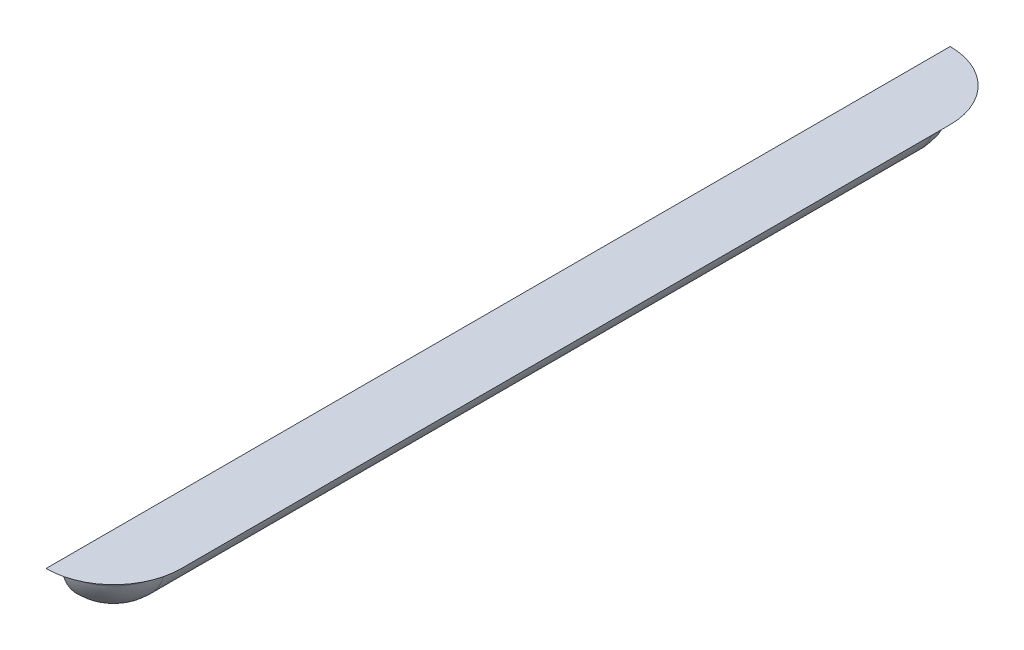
from build123d import *

# Parameters (mm, degrees)
SKETCH1_W           = 30
SKETCH1_H           = 3.464243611
BASE_EXTRUDE_DEPTH  = 60
BOSS_EXTRUDE1_DEPTH = 44
BOSS_REVOLVE2_ANGLE = 90
BOSS_REVOLVE3_ANGLE = 90
FILLET1_R           = 2
SKETCH8_W           = 120
SKETCH8_H           = 3.464243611
CUT_EXTRUDE4_DEPTH  = 68.349833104


with BuildPart() as part:
    # Sketch1 → Base-Extrude (new, symmetric)
    with BuildSketch(Plane.XY):
        with Locations((0, 1.732121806)):
            Rectangle(SKETCH1_W, SKETCH1_H)
    extrude(amount=BASE_EXTRUDE_DEPTH, both=True)

    # Louver Body → Boss-Extrude1 (add, symmetric)
    with BuildSketch(Plane.XY):
        with BuildLine():
            Line((-3, 0), (-3, -6))
            ThreePointArc((-3, -6), (1.242640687, -4.242640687), (3, 0))
            Line((3, 0), (-3, 0))
        make_face()
    extrude(amount=BOSS_EXTRUDE1_DEPTH, both=True)

    # Sketch12 → Boss-Revolve2 (revolve)
    with BuildSketch(Plane.XY.offset(44)):
        with BuildLine():
            Line((3, 0), (-3, 0))
            Line((-3, 0), (-3, -6))
            ThreePointArc((-3, -6), (1.242640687, -4.242640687), (3, 0))
        make_face()
    revolve(axis=Axis((-3, 0, 44), (0, -1, 0)), revolution_arc=BOSS_REVOLVE2_ANGLE)

    # Sketch13 → Boss-Revolve3 (revolve)
    with BuildSketch(Plane(origin=(0, 0, -44), x_dir=(-1, 0, 0), z_dir=(0, 0, -1))):
        with BuildLine():
            Line((3, 0), (-3, 0))
            ThreePointArc((-3, 0), (-1.242640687, -4.242640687), (3, -6))
            Line((3, -6), (3, 0))
        make_face()
    revolve(axis=Axis((-3, -6, -44), (0, 1, 0)), revolution_arc=BOSS_REVOLVE3_ANGLE)

    # Fillet1
    fillet1_edges = [part.edges().sort_by_distance(p)[0] for p in [
        (3, 0, 0),
        (1.242640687, 0, 48.242640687),
        (1.242640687, 0, -48.242640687),
    ]]
    fillet(fillet1_edges, radius=FILLET1_R)

    # Sketch8 → Cut-Extrude4 (cut, through all)
    with BuildSketch(Plane.ZY.offset(15)):
        with Locations((0, 1.732121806)):
            Rectangle(SKETCH8_W, SKETCH8_H)
    extrude(amount=-CUT_EXTRUDE4_DEPTH, mode=Mode.SUBTRACT)


solid = part.part
